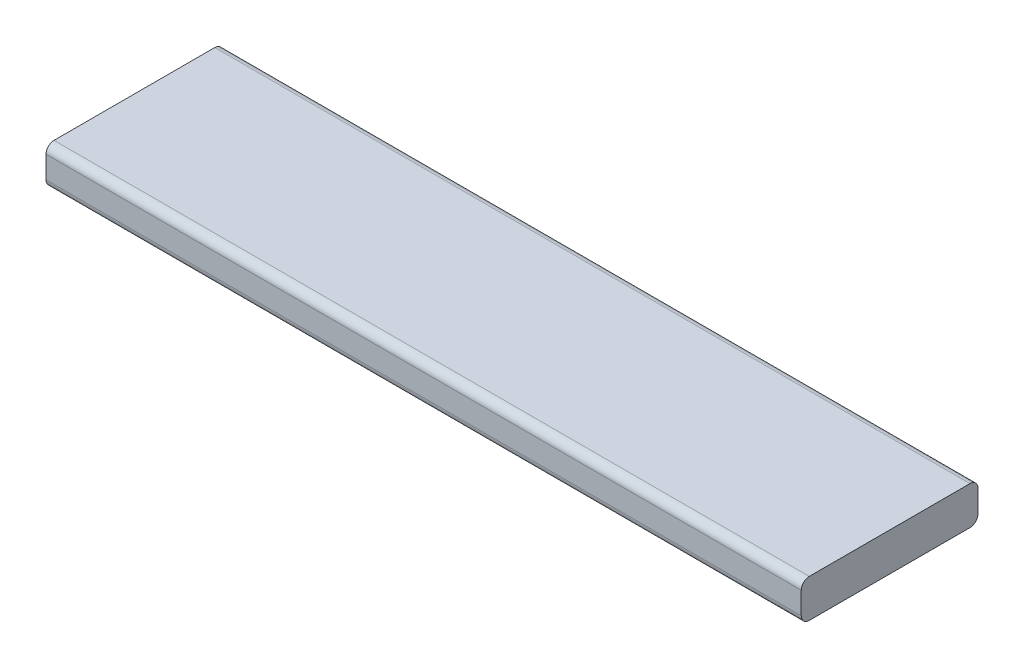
from build123d import *

# Parameters (mm, degrees)
SKETCH2_W           = 139.7
SKETCH2_H           = 30.1625
BOSS_EXTRUDE1_DEPTH = 596.9
FILLET1_R           = 6.35


with BuildPart() as part:
    # Sketch2 → Boss-Extrude1 (new body)
    with BuildSketch(Plane(origin=(0, 0, 0), x_dir=(0, 0, -1), z_dir=(1, 0, 0))):
        with Locations((-69.85, 15.08125)):
            Rectangle(SKETCH2_W, SKETCH2_H)
    extrude(amount=BOSS_EXTRUDE1_DEPTH)

    # Fillet1
    fillet1_edges = [part.edges().sort_by_distance(p)[0] for p in [
        (298.45, 30.1625, 139.7),
        (298.45, 0, 139.7),
        (298.45, 0, 0),
        (298.45, 30.1625, 0),
    ]]
    fillet(fillet1_edges, radius=FILLET1_R)


solid = part.part
